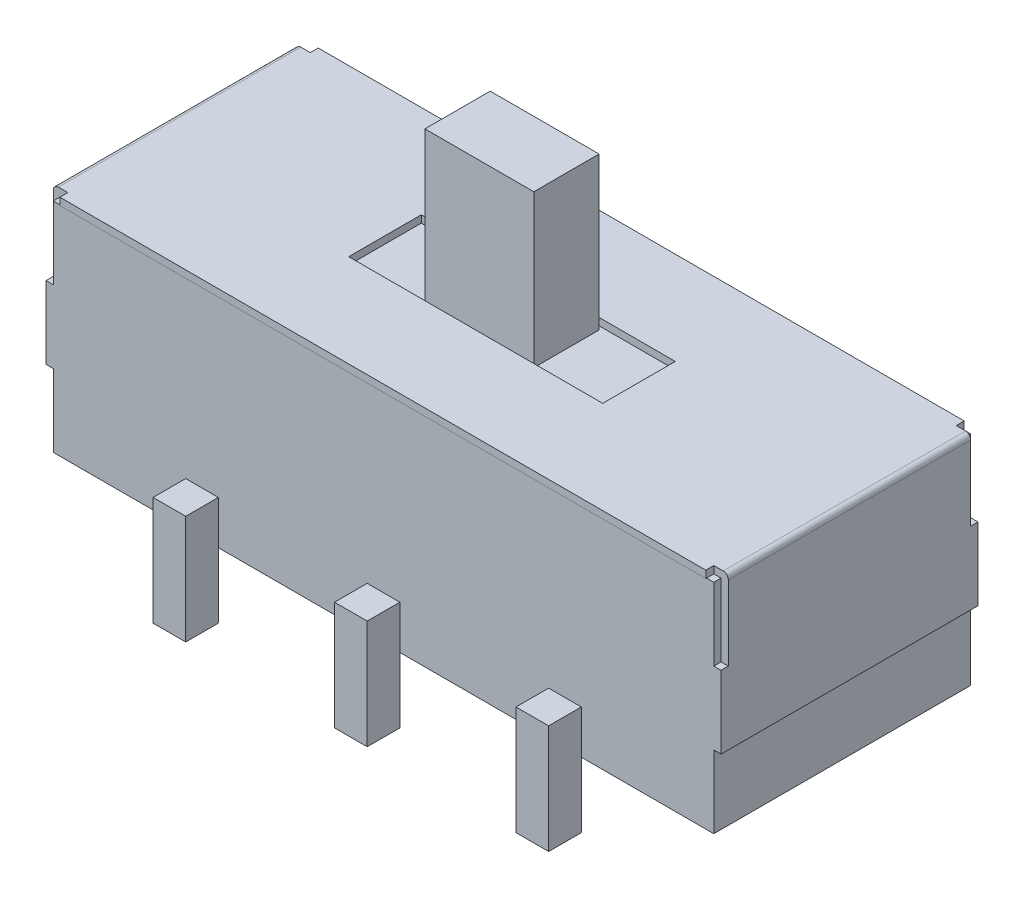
from build123d import *

# Parameters (mm, degrees)
BOSS_EXTRU_1_DEPTH      = 1.77
BOSS_EXTRU_1_DEPTH_BACK = 1.77
ESQUISSE1_W             = 9.1
ESQUISSE1_H             = 3
ESQUISSE2_W             = 3.5
ESQUISSE2_H             = 1
BOSS_EXTRU_2_DEPTH      = 0.1
BOSS_EXTRU_3_DEPTH      = 0.1
CONG_1_R                = 0.07
ESQUISSE4_W             = 1.5
ESQUISSE4_H             = 0.9
BOSS_EXTRU_4_DEPTH      = 2.1
ESQUISSE6_W             = 0.45
ESQUISSE6_H             = 1.6
BOSS_EXTRU_5_DEPTH      = 0.45
CHANFREIN1_SIZE         = 0.1


with BuildPart() as part:
    # Esquisse1 → Boss.-Extru.1 (new, two sides: drawn at the far end of the back side and taken through both)
    with BuildSketch(Plane.XY.offset(-BOSS_EXTRU_1_DEPTH_BACK)):
        with Locations((0, 1.5)):
            Rectangle(ESQUISSE1_W, ESQUISSE1_H)
    extrude(amount=BOSS_EXTRU_1_DEPTH + BOSS_EXTRU_1_DEPTH_BACK)

    # Esquisse2 → Boss.-Extru.2 (add)
    with BuildSketch(Plane(origin=(0, 3, 0), x_dir=(1, 0, 0), z_dir=(0, 1, 0))):
        Polygon((-4.65, 1.67), (-4.65, -1.67), (-4.45, -1.67), (-4.45, -1.78), (4.45, -1.78), (4.45, -1.67), (4.65, -1.67), (4.65, 1.67), (4.45, 1.67), (4.45, 1.78), (-4.45, 1.78), (-4.45, 1.67), align=None)
        Rectangle(ESQUISSE2_W, ESQUISSE2_H, mode=Mode.SUBTRACT)
    extrude(amount=BOSS_EXTRU_2_DEPTH)

    # Esquisse3 → Boss.-Extru.3 (add)
    with BuildSketch(Plane.ZY.offset(4.55)):
        Polygon((-1.77, 1), (1.77, 1), (1.77, 2), (1.67, 2), (1.67, 3), (-1.67, 3), (-1.67, 2), (-1.77, 2), align=None)
    boss_extru_3 = extrude(amount=BOSS_EXTRU_3_DEPTH)

    # Sym_trie1: Boss.-Extru.3 across plane
    add(boss_extru_3.mirror(Plane(origin=(0, 0, 0), x_dir=(0, 0, 1), z_dir=(1, 0, 0))))

    # Cong_1
    cong_1_edges = [part.edges().sort_by_distance(p)[0] for p in [
        (-4.65, 3.1, 0),
        (4.65, 3.1, 0),
    ]]
    fillet(cong_1_edges, radius=CONG_1_R)

    # Esquisse4 → Boss.-Extru.4 (add)
    with BuildSketch(Plane(origin=(0, 3, 0), x_dir=(1, 0, 0), z_dir=(0, 1, 0))):
        Rectangle(ESQUISSE4_W, ESQUISSE4_H)
    extrude(amount=BOSS_EXTRU_4_DEPTH)

    # Esquisse6 → Boss.-Extru.5 (add)
    with BuildSketch(Plane(origin=(0, 0, -1.77), x_dir=(-1, 0, 0), z_dir=(0, 0, -1))):
        with Locations((0, -0.2)):
            Rectangle(ESQUISSE6_W, ESQUISSE6_H)
        with Locations((-2.5, -0.2)):
            Rectangle(ESQUISSE6_W, ESQUISSE6_H)
        with Locations((2.5, -0.2)):
            Rectangle(ESQUISSE6_W, ESQUISSE6_H)
    boss_extru_5 = extrude(amount=BOSS_EXTRU_5_DEPTH)

    # Sym_trie2: Boss.-Extru.5 across plane
    add(boss_extru_5.mirror(Plane.XY))

    # Chanfrein1
    chanfrein1_edges = [part.edges().sort_by_distance(p)[0] for p in [
        (-0.225, -1, -1.995),
        (0, -1, -1.77),
        (0.225, -1, -1.995),
        (0, -1, -2.22),
        (2.275, -1, -1.995),
        (2.5, -1, -1.77),
        (2.725, -1, -1.995),
        (2.5, -1, -2.22),
        (-2.5, -1, -1.77),
        (-2.275, -1, -1.995),
        (-2.725, -1, -1.995),
        (-2.5, -1, -2.22),
        (0, -1, 2.22),
        (-0.225, -1, 1.995),
        (0.225, -1, 1.995),
        (0, -1, 1.77),
        (2.5, -1, 2.22),
        (2.275, -1, 1.995),
        (2.725, -1, 1.995),
        (2.5, -1, 1.77),
        (-2.275, -1, 1.995),
        (-2.5, -1, 2.22),
        (-2.725, -1, 1.995),
        (-2.5, -1, 1.77),
    ]]
    chamfer(chanfrein1_edges, length=CHANFREIN1_SIZE)


solid = part.part
